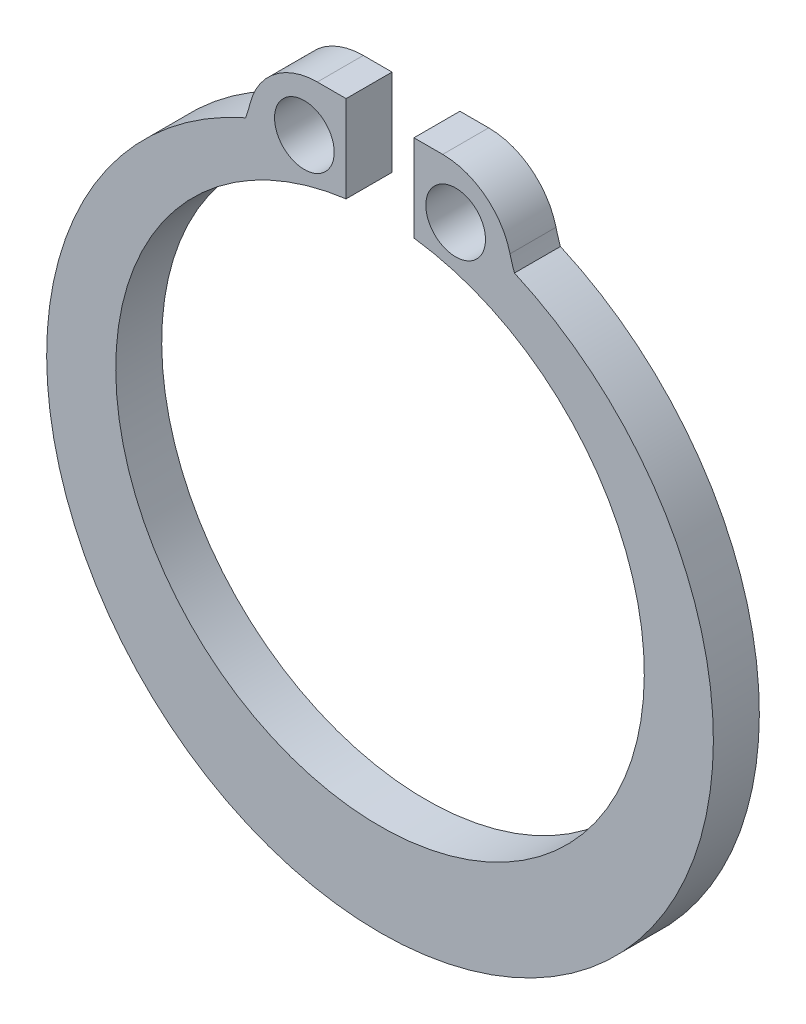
ISO-10303-21;
HEADER;
FILE_DESCRIPTION(('STEP AP214'),'2;1');
FILE_NAME('part.step','',(''),(''),'','','');
FILE_SCHEMA(('AUTOMOTIVE_DESIGN { 1 0 10303 214 1 1 1 1 }'));
ENDSEC;
DATA;
#1=APPLICATION_CONTEXT('core data for automotive mechanical design processes');
#2=APPLICATION_PROTOCOL_DEFINITION('international standard','automotive_design',2000,#1);
#3=PRODUCT_CONTEXT('',#1,'mechanical');
#4=PRODUCT('Part','Part','',(#3));
#5=PRODUCT_RELATED_PRODUCT_CATEGORY('part','',(#4));
#6=PRODUCT_DEFINITION_FORMATION('','',#4);
#7=PRODUCT_DEFINITION_CONTEXT('part definition',#1,'design');
#8=PRODUCT_DEFINITION('design','',#6,#7);
#9=PRODUCT_DEFINITION_SHAPE('','',#8);
#10=(LENGTH_UNIT() NAMED_UNIT(*) SI_UNIT(.MILLI.,.METRE.));
#11=(NAMED_UNIT(*) PLANE_ANGLE_UNIT() SI_UNIT($,.RADIAN.));
#12=(NAMED_UNIT(*) SI_UNIT($,.STERADIAN.) SOLID_ANGLE_UNIT());
#13=UNCERTAINTY_MEASURE_WITH_UNIT(LENGTH_MEASURE(1.E-05),#10,'distance_accuracy_value','');
#14=(GEOMETRIC_REPRESENTATION_CONTEXT(3) GLOBAL_UNCERTAINTY_ASSIGNED_CONTEXT((#13)) GLOBAL_UNIT_ASSIGNED_CONTEXT((#10,
#11,#12)) REPRESENTATION_CONTEXT('',''));
#15=CARTESIAN_POINT('',(0.,0.,0.));
#16=DIRECTION('',(0.,0.,1.));
#17=DIRECTION('',(1.,0.,0.));
#18=AXIS2_PLACEMENT_3D('',#15,#16,#17);
#19=CARTESIAN_POINT('',(4.44089209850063E-13,0.499999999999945,1.));
#20=DIRECTION('',(0.,0.,1.));
#21=DIRECTION('',(1.,0.,0.));
#22=AXIS2_PLACEMENT_3D('',#19,#20,#21);
#23=PLANE('',#22);
#24=CARTESIAN_POINT('',(1.6460721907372,6.95112406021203,1.));
#25=DIRECTION('',(0.,0.,-1.));
#26=DIRECTION('',(-1.,0.,0.));
#27=AXIS2_PLACEMENT_3D('',#24,#25,#26);
#28=CIRCLE('',#27,0.649210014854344);
#29=CARTESIAN_POINT('',(0.996862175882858,6.95112406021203,1.));
#30=VERTEX_POINT('',#29);
#31=EDGE_CURVE('E199',#30,#30,#28,.T.);
#32=ORIENTED_EDGE('',*,*,#31,.T.);
#33=EDGE_LOOP('',(#32));
#34=FACE_BOUND('',#33,.T.);
#35=CARTESIAN_POINT('',(4.44089209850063E-13,0.499999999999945,1.));
#36=DIRECTION('',(0.,0.,1.));
#37=DIRECTION('',(1.,0.,0.));
#38=AXIS2_PLACEMENT_3D('',#35,#36,#37);
#39=CIRCLE('',#38,5.75);
#40=CARTESIAN_POINT('',(-0.737991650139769,6.20244406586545,1.));
#41=VERTEX_POINT('',#40);
#42=CARTESIAN_POINT('',(0.737991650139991,6.20244406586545,1.));
#43=VERTEX_POINT('',#42);
#44=EDGE_CURVE('E117',#41,#43,#39,.T.);
#45=ORIENTED_EDGE('',*,*,#44,.F.);
#46=DIRECTION('',(0.,-1.,0.));
#47=VECTOR('',#46,1.);
#48=CARTESIAN_POINT('',(-0.737991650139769,8.09216813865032,1.));
#49=LINE('',#48,#47);
#50=CARTESIAN_POINT('',(-0.737991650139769,8.09216813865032,1.));
#51=VERTEX_POINT('',#50);
#52=EDGE_CURVE('E181',#51,#41,#49,.T.);
#53=ORIENTED_EDGE('',*,*,#52,.F.);
#54=DIRECTION('',(-1.,0.,0.));
#55=VECTOR('',#54,1.);
#56=CARTESIAN_POINT('',(-0.737991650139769,8.09216813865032,1.));
#57=LINE('',#56,#55);
#58=CARTESIAN_POINT('',(-1.36399396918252,8.09216813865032,1.));
#59=VERTEX_POINT('',#58);
#60=EDGE_CURVE('E114',#51,#59,#57,.T.);
#61=ORIENTED_EDGE('',*,*,#60,.T.);
#62=CARTESIAN_POINT('',(-1.36399396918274,6.58162042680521,1.));
#63=DIRECTION('',(0.,0.,1.));
#64=DIRECTION('',(1.,0.,0.));
#65=AXIS2_PLACEMENT_3D('',#62,#63,#64);
#66=CIRCLE('',#65,1.51054771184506);
#67=CARTESIAN_POINT('',(-2.82865142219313,6.95112406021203,1.));
#68=VERTEX_POINT('',#67);
#69=EDGE_CURVE('E187',#59,#68,#66,.T.);
#70=ORIENTED_EDGE('',*,*,#69,.T.);
#71=CARTESIAN_POINT('',(-5.98071916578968,7.74632739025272,1.));
#72=DIRECTION('',(0.,0.,-1.));
#73=DIRECTION('',(-1.,0.,0.));
#74=AXIS2_PLACEMENT_3D('',#71,#72,#73);
#75=CIRCLE('',#74,3.25082749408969);
#76=CARTESIAN_POINT('',(-2.92503228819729,6.63697753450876,1.));
#77=VERTEX_POINT('',#76);
#78=EDGE_CURVE('E185',#68,#77,#75,.T.);
#79=ORIENTED_EDGE('',*,*,#78,.T.);
#80=CARTESIAN_POINT('',(0.,0.,1.));
#81=DIRECTION('',(0.,0.,1.));
#82=DIRECTION('',(1.,0.,0.));
#83=AXIS2_PLACEMENT_3D('',#80,#81,#82);
#84=CIRCLE('',#83,7.25295006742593);
#85=CARTESIAN_POINT('',(2.92503228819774,6.63697753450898,1.));
#86=VERTEX_POINT('',#85);
#87=EDGE_CURVE('E110',#77,#86,#84,.T.);
#88=ORIENTED_EDGE('',*,*,#87,.T.);
#89=CARTESIAN_POINT('',(5.98071916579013,7.74632739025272,1.));
#90=DIRECTION('',(0.,0.,1.));
#91=DIRECTION('',(1.,0.,0.));
#92=AXIS2_PLACEMENT_3D('',#89,#90,#91);
#93=CIRCLE('',#92,3.25082749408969);
#94=CARTESIAN_POINT('',(2.8286514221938,6.95112406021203,1.));
#95=VERTEX_POINT('',#94);
#96=EDGE_CURVE('E108',#95,#86,#93,.T.);
#97=ORIENTED_EDGE('',*,*,#96,.F.);
#98=CARTESIAN_POINT('',(1.36399396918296,6.58162042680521,1.));
#99=DIRECTION('',(0.,0.,-1.));
#100=DIRECTION('',(-1.,0.,0.));
#101=AXIS2_PLACEMENT_3D('',#98,#99,#100);
#102=CIRCLE('',#101,1.51054771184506);
#103=CARTESIAN_POINT('',(1.36399396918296,8.09216813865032,1.));
#104=VERTEX_POINT('',#103);
#105=EDGE_CURVE('E85',#104,#95,#102,.T.);
#106=ORIENTED_EDGE('',*,*,#105,.F.);
#107=DIRECTION('',(1.,0.,0.));
#108=VECTOR('',#107,1.);
#109=CARTESIAN_POINT('',(0.737991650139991,8.09216813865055,1.));
#110=LINE('',#109,#108);
#111=CARTESIAN_POINT('',(0.737991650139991,8.09216813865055,1.));
#112=VERTEX_POINT('',#111);
#113=EDGE_CURVE('E97',#112,#104,#110,.T.);
#114=ORIENTED_EDGE('',*,*,#113,.F.);
#115=DIRECTION('',(0.,-1.,0.));
#116=VECTOR('',#115,1.);
#117=CARTESIAN_POINT('',(0.737991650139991,8.09216813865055,1.));
#118=LINE('',#117,#116);
#119=EDGE_CURVE('E102',#112,#43,#118,.T.);
#120=ORIENTED_EDGE('',*,*,#119,.T.);
#121=EDGE_LOOP('',(#45,#53,#61,#70,#79,#88,#97,#106,#114,#120));
#122=FACE_BOUND('',#121,.T.);
#123=CARTESIAN_POINT('',(-1.64607219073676,6.95112406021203,1.));
#124=DIRECTION('',(0.,0.,1.));
#125=DIRECTION('',(1.,0.,0.));
#126=AXIS2_PLACEMENT_3D('',#123,#124,#125);
#127=CIRCLE('',#126,0.649210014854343);
#128=CARTESIAN_POINT('',(-0.996862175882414,6.95112406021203,1.));
#129=VERTEX_POINT('',#128);
#130=EDGE_CURVE('E159',#129,#129,#127,.T.);
#131=ORIENTED_EDGE('',*,*,#130,.F.);
#132=EDGE_LOOP('',(#131));
#133=FACE_BOUND('',#132,.T.);
#134=ADVANCED_FACE('F30',(#34,#122,#133),#23,.T.);
#135=CARTESIAN_POINT('',(4.44089209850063E-13,0.499999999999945,0.));
#136=DIRECTION('',(0.,0.,1.));
#137=DIRECTION('',(1.,0.,0.));
#138=AXIS2_PLACEMENT_3D('',#135,#136,#137);
#139=PLANE('',#138);
#140=CARTESIAN_POINT('',(1.6460721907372,6.95112406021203,0.));
#141=DIRECTION('',(0.,0.,-1.));
#142=DIRECTION('',(-1.,0.,0.));
#143=AXIS2_PLACEMENT_3D('',#140,#141,#142);
#144=CIRCLE('',#143,0.649210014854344);
#145=CARTESIAN_POINT('',(0.996862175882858,6.95112406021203,0.));
#146=VERTEX_POINT('',#145);
#147=EDGE_CURVE('E202',#146,#146,#144,.T.);
#148=ORIENTED_EDGE('',*,*,#147,.F.);
#149=EDGE_LOOP('',(#148));
#150=FACE_BOUND('',#149,.T.);
#151=CARTESIAN_POINT('',(4.44089209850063E-13,0.499999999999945,0.));
#152=DIRECTION('',(0.,0.,1.));
#153=DIRECTION('',(1.,0.,0.));
#154=AXIS2_PLACEMENT_3D('',#151,#152,#153);
#155=CIRCLE('',#154,5.75);
#156=CARTESIAN_POINT('',(-0.737991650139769,6.20244406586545,0.));
#157=VERTEX_POINT('',#156);
#158=CARTESIAN_POINT('',(0.737991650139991,6.20244406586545,0.));
#159=VERTEX_POINT('',#158);
#160=EDGE_CURVE('E182',#157,#159,#155,.T.);
#161=ORIENTED_EDGE('',*,*,#160,.T.);
#162=DIRECTION('',(0.,-1.,0.));
#163=VECTOR('',#162,1.);
#164=CARTESIAN_POINT('',(0.737991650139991,8.09216813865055,0.));
#165=LINE('',#164,#163);
#166=CARTESIAN_POINT('',(0.737991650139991,8.09216813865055,0.));
#167=VERTEX_POINT('',#166);
#168=EDGE_CURVE('E194',#167,#159,#165,.T.);
#169=ORIENTED_EDGE('',*,*,#168,.F.);
#170=DIRECTION('',(1.,0.,0.));
#171=VECTOR('',#170,1.);
#172=CARTESIAN_POINT('',(0.737991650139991,8.09216813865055,0.));
#173=LINE('',#172,#171);
#174=CARTESIAN_POINT('',(1.36399396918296,8.09216813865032,0.));
#175=VERTEX_POINT('',#174);
#176=EDGE_CURVE('E166',#167,#175,#173,.T.);
#177=ORIENTED_EDGE('',*,*,#176,.T.);
#178=CARTESIAN_POINT('',(1.36399396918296,6.58162042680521,0.));
#179=DIRECTION('',(0.,0.,-1.));
#180=DIRECTION('',(-1.,0.,0.));
#181=AXIS2_PLACEMENT_3D('',#178,#179,#180);
#182=CIRCLE('',#181,1.51054771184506);
#183=CARTESIAN_POINT('',(2.8286514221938,6.95112406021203,0.));
#184=VERTEX_POINT('',#183);
#185=EDGE_CURVE('E89',#175,#184,#182,.T.);
#186=ORIENTED_EDGE('',*,*,#185,.T.);
#187=CARTESIAN_POINT('',(5.98071916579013,7.74632739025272,0.));
#188=DIRECTION('',(0.,0.,1.));
#189=DIRECTION('',(1.,0.,0.));
#190=AXIS2_PLACEMENT_3D('',#187,#188,#189);
#191=CIRCLE('',#190,3.25082749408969);
#192=CARTESIAN_POINT('',(2.92503228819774,6.63697753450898,0.));
#193=VERTEX_POINT('',#192);
#194=EDGE_CURVE('E168',#184,#193,#191,.T.);
#195=ORIENTED_EDGE('',*,*,#194,.T.);
#196=CARTESIAN_POINT('',(0.,0.,0.));
#197=DIRECTION('',(0.,0.,1.));
#198=DIRECTION('',(1.,0.,0.));
#199=AXIS2_PLACEMENT_3D('',#196,#197,#198);
#200=CIRCLE('',#199,7.25295006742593);
#201=CARTESIAN_POINT('',(-2.92503228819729,6.63697753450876,0.));
#202=VERTEX_POINT('',#201);
#203=EDGE_CURVE('E171',#202,#193,#200,.T.);
#204=ORIENTED_EDGE('',*,*,#203,.F.);
#205=CARTESIAN_POINT('',(-5.98071916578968,7.74632739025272,0.));
#206=DIRECTION('',(0.,0.,-1.));
#207=DIRECTION('',(-1.,0.,0.));
#208=AXIS2_PLACEMENT_3D('',#205,#206,#207);
#209=CIRCLE('',#208,3.25082749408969);
#210=CARTESIAN_POINT('',(-2.82865142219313,6.95112406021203,0.));
#211=VERTEX_POINT('',#210);
#212=EDGE_CURVE('E174',#211,#202,#209,.T.);
#213=ORIENTED_EDGE('',*,*,#212,.F.);
#214=CARTESIAN_POINT('',(-1.36399396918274,6.58162042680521,0.));
#215=DIRECTION('',(0.,0.,1.));
#216=DIRECTION('',(1.,0.,0.));
#217=AXIS2_PLACEMENT_3D('',#214,#215,#216);
#218=CIRCLE('',#217,1.51054771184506);
#219=CARTESIAN_POINT('',(-1.36399396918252,8.09216813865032,0.));
#220=VERTEX_POINT('',#219);
#221=EDGE_CURVE('E156',#220,#211,#218,.T.);
#222=ORIENTED_EDGE('',*,*,#221,.F.);
#223=DIRECTION('',(-1.,0.,0.));
#224=VECTOR('',#223,1.);
#225=CARTESIAN_POINT('',(-0.737991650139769,8.09216813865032,0.));
#226=LINE('',#225,#224);
#227=CARTESIAN_POINT('',(-0.737991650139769,8.09216813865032,0.));
#228=VERTEX_POINT('',#227);
#229=EDGE_CURVE('E139',#228,#220,#226,.T.);
#230=ORIENTED_EDGE('',*,*,#229,.F.);
#231=DIRECTION('',(0.,-1.,0.));
#232=VECTOR('',#231,1.);
#233=CARTESIAN_POINT('',(-0.737991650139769,8.09216813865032,0.));
#234=LINE('',#233,#232);
#235=EDGE_CURVE('E153',#228,#157,#234,.T.);
#236=ORIENTED_EDGE('',*,*,#235,.T.);
#237=EDGE_LOOP('',(#161,#169,#177,#186,#195,#204,#213,#222,#230,#236));
#238=FACE_BOUND('',#237,.T.);
#239=CARTESIAN_POINT('',(-1.64607219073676,6.95112406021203,0.));
#240=DIRECTION('',(0.,0.,1.));
#241=DIRECTION('',(1.,0.,0.));
#242=AXIS2_PLACEMENT_3D('',#239,#240,#241);
#243=CIRCLE('',#242,0.649210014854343);
#244=CARTESIAN_POINT('',(-0.996862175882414,6.95112406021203,0.));
#245=VERTEX_POINT('',#244);
#246=EDGE_CURVE('E162',#245,#245,#243,.T.);
#247=ORIENTED_EDGE('',*,*,#246,.T.);
#248=EDGE_LOOP('',(#247));
#249=FACE_BOUND('',#248,.T.);
#250=ADVANCED_FACE('F151',(#150,#238,#249),#139,.F.);
#251=CARTESIAN_POINT('',(4.44089209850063E-13,0.499999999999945,1.));
#252=DIRECTION('',(0.,0.,-1.));
#253=DIRECTION('',(-1.,0.,0.));
#254=AXIS2_PLACEMENT_3D('',#251,#252,#253);
#255=CYLINDRICAL_SURFACE('',#254,5.75);
#256=DIRECTION('',(0.,0.,-1.));
#257=VECTOR('',#256,1.);
#258=CARTESIAN_POINT('',(-0.737991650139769,6.20244406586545,1.));
#259=LINE('',#258,#257);
#260=EDGE_CURVE('E11',#41,#157,#259,.T.);
#261=ORIENTED_EDGE('',*,*,#260,.F.);
#262=ORIENTED_EDGE('',*,*,#44,.T.);
#263=DIRECTION('',(0.,0.,-1.));
#264=VECTOR('',#263,1.);
#265=CARTESIAN_POINT('',(0.737991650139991,6.20244406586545,1.));
#266=LINE('',#265,#264);
#267=EDGE_CURVE('E46',#43,#159,#266,.T.);
#268=ORIENTED_EDGE('',*,*,#267,.T.);
#269=ORIENTED_EDGE('',*,*,#160,.F.);
#270=EDGE_LOOP('',(#261,#262,#268,#269));
#271=FACE_BOUND('',#270,.T.);
#272=ADVANCED_FACE('F191',(#271),#255,.F.);
#273=CARTESIAN_POINT('',(-0.737991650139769,8.09216813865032,1.));
#274=DIRECTION('',(1.,0.,0.));
#275=DIRECTION('',(0.,1.,0.));
#276=AXIS2_PLACEMENT_3D('',#273,#274,#275);
#277=PLANE('',#276);
#278=DIRECTION('',(0.,0.,-1.));
#279=VECTOR('',#278,1.);
#280=CARTESIAN_POINT('',(-0.737991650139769,8.09216813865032,1.));
#281=LINE('',#280,#279);
#282=EDGE_CURVE('E39',#51,#228,#281,.T.);
#283=ORIENTED_EDGE('',*,*,#282,.F.);
#284=ORIENTED_EDGE('',*,*,#52,.T.);
#285=ORIENTED_EDGE('',*,*,#260,.T.);
#286=ORIENTED_EDGE('',*,*,#235,.F.);
#287=EDGE_LOOP('',(#283,#284,#285,#286));
#288=FACE_BOUND('',#287,.T.);
#289=ADVANCED_FACE('F32',(#288),#277,.T.);
#290=CARTESIAN_POINT('',(-0.737991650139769,8.09216813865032,1.));
#291=DIRECTION('',(0.,-1.,0.));
#292=DIRECTION('',(0.,0.,-1.));
#293=AXIS2_PLACEMENT_3D('',#290,#291,#292);
#294=PLANE('',#293);
#295=DIRECTION('',(0.,0.,-1.));
#296=VECTOR('',#295,1.);
#297=CARTESIAN_POINT('',(-1.36399396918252,8.09216813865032,1.));
#298=LINE('',#297,#296);
#299=EDGE_CURVE('E129',#59,#220,#298,.T.);
#300=ORIENTED_EDGE('',*,*,#299,.F.);
#301=ORIENTED_EDGE('',*,*,#60,.F.);
#302=ORIENTED_EDGE('',*,*,#282,.T.);
#303=ORIENTED_EDGE('',*,*,#229,.T.);
#304=EDGE_LOOP('',(#300,#301,#302,#303));
#305=FACE_BOUND('',#304,.T.);
#306=ADVANCED_FACE('F137',(#305),#294,.F.);
#307=CARTESIAN_POINT('',(-1.36399396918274,6.58162042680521,1.));
#308=DIRECTION('',(0.,0.,-1.));
#309=DIRECTION('',(-1.,0.,0.));
#310=AXIS2_PLACEMENT_3D('',#307,#308,#309);
#311=CYLINDRICAL_SURFACE('',#310,1.51054771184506);
#312=DIRECTION('',(0.,0.,-1.));
#313=VECTOR('',#312,1.);
#314=CARTESIAN_POINT('',(-2.82865142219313,6.95112406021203,1.));
#315=LINE('',#314,#313);
#316=EDGE_CURVE('E126',#68,#211,#315,.T.);
#317=ORIENTED_EDGE('',*,*,#316,.F.);
#318=ORIENTED_EDGE('',*,*,#69,.F.);
#319=ORIENTED_EDGE('',*,*,#299,.T.);
#320=ORIENTED_EDGE('',*,*,#221,.T.);
#321=EDGE_LOOP('',(#317,#318,#319,#320));
#322=FACE_BOUND('',#321,.T.);
#323=ADVANCED_FACE('F239',(#322),#311,.T.);
#324=CARTESIAN_POINT('',(-5.98071916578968,7.74632739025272,1.));
#325=DIRECTION('',(0.,0.,-1.));
#326=DIRECTION('',(-1.,0.,0.));
#327=AXIS2_PLACEMENT_3D('',#324,#325,#326);
#328=CYLINDRICAL_SURFACE('',#327,3.25082749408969);
#329=DIRECTION('',(0.,0.,-1.));
#330=VECTOR('',#329,1.);
#331=CARTESIAN_POINT('',(-2.92503228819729,6.63697753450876,1.));
#332=LINE('',#331,#330);
#333=EDGE_CURVE('E123',#77,#202,#332,.T.);
#334=ORIENTED_EDGE('',*,*,#333,.F.);
#335=ORIENTED_EDGE('',*,*,#78,.F.);
#336=ORIENTED_EDGE('',*,*,#316,.T.);
#337=ORIENTED_EDGE('',*,*,#212,.T.);
#338=EDGE_LOOP('',(#334,#335,#336,#337));
#339=FACE_BOUND('',#338,.T.);
#340=ADVANCED_FACE('F235',(#339),#328,.F.);
#341=CARTESIAN_POINT('',(0.,0.,1.));
#342=DIRECTION('',(0.,0.,-1.));
#343=DIRECTION('',(-1.,0.,0.));
#344=AXIS2_PLACEMENT_3D('',#341,#342,#343);
#345=CYLINDRICAL_SURFACE('',#344,7.25295006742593);
#346=DIRECTION('',(0.,0.,-1.));
#347=VECTOR('',#346,1.);
#348=CARTESIAN_POINT('',(2.92503228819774,6.63697753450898,1.));
#349=LINE('',#348,#347);
#350=EDGE_CURVE('E120',#86,#193,#349,.T.);
#351=ORIENTED_EDGE('',*,*,#350,.F.);
#352=ORIENTED_EDGE('',*,*,#87,.F.);
#353=ORIENTED_EDGE('',*,*,#333,.T.);
#354=ORIENTED_EDGE('',*,*,#203,.T.);
#355=EDGE_LOOP('',(#351,#352,#353,#354));
#356=FACE_BOUND('',#355,.T.);
#357=ADVANCED_FACE('F231',(#356),#345,.T.);
#358=CARTESIAN_POINT('',(5.98071916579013,7.74632739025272,1.));
#359=DIRECTION('',(0.,0.,-1.));
#360=DIRECTION('',(-1.,0.,0.));
#361=AXIS2_PLACEMENT_3D('',#358,#359,#360);
#362=CYLINDRICAL_SURFACE('',#361,3.25082749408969);
#363=DIRECTION('',(0.,0.,-1.));
#364=VECTOR('',#363,1.);
#365=CARTESIAN_POINT('',(2.8286514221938,6.95112406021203,1.));
#366=LINE('',#365,#364);
#367=EDGE_CURVE('E93',#95,#184,#366,.T.);
#368=ORIENTED_EDGE('',*,*,#367,.F.);
#369=ORIENTED_EDGE('',*,*,#96,.T.);
#370=ORIENTED_EDGE('',*,*,#350,.T.);
#371=ORIENTED_EDGE('',*,*,#194,.F.);
#372=EDGE_LOOP('',(#368,#369,#370,#371));
#373=FACE_BOUND('',#372,.T.);
#374=ADVANCED_FACE('F228',(#373),#362,.F.);
#375=CARTESIAN_POINT('',(1.36399396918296,6.58162042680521,1.));
#376=DIRECTION('',(0.,0.,-1.));
#377=DIRECTION('',(-1.,0.,0.));
#378=AXIS2_PLACEMENT_3D('',#375,#376,#377);
#379=CYLINDRICAL_SURFACE('',#378,1.51054771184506);
#380=DIRECTION('',(0.,0.,-1.));
#381=VECTOR('',#380,1.);
#382=CARTESIAN_POINT('',(1.36399396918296,8.09216813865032,1.));
#383=LINE('',#382,#381);
#384=EDGE_CURVE('E80',#104,#175,#383,.T.);
#385=ORIENTED_EDGE('',*,*,#384,.F.);
#386=ORIENTED_EDGE('',*,*,#105,.T.);
#387=ORIENTED_EDGE('',*,*,#367,.T.);
#388=ORIENTED_EDGE('',*,*,#185,.F.);
#389=EDGE_LOOP('',(#385,#386,#387,#388));
#390=FACE_BOUND('',#389,.T.);
#391=ADVANCED_FACE('F82',(#390),#379,.T.);
#392=CARTESIAN_POINT('',(0.737991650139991,8.09216813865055,1.));
#393=DIRECTION('',(0.,1.,0.));
#394=DIRECTION('',(0.,0.,1.));
#395=AXIS2_PLACEMENT_3D('',#392,#393,#394);
#396=PLANE('',#395);
#397=DIRECTION('',(0.,0.,-1.));
#398=VECTOR('',#397,1.);
#399=CARTESIAN_POINT('',(0.737991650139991,8.09216813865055,1.));
#400=LINE('',#399,#398);
#401=EDGE_CURVE('E94',#112,#167,#400,.T.);
#402=ORIENTED_EDGE('',*,*,#401,.F.);
#403=ORIENTED_EDGE('',*,*,#113,.T.);
#404=ORIENTED_EDGE('',*,*,#384,.T.);
#405=ORIENTED_EDGE('',*,*,#176,.F.);
#406=EDGE_LOOP('',(#402,#403,#404,#405));
#407=FACE_BOUND('',#406,.T.);
#408=ADVANCED_FACE('F98',(#407),#396,.T.);
#409=CARTESIAN_POINT('',(0.737991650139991,8.09216813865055,1.));
#410=DIRECTION('',(1.,0.,0.));
#411=DIRECTION('',(0.,1.,0.));
#412=AXIS2_PLACEMENT_3D('',#409,#410,#411);
#413=PLANE('',#412);
#414=ORIENTED_EDGE('',*,*,#119,.F.);
#415=ORIENTED_EDGE('',*,*,#401,.T.);
#416=ORIENTED_EDGE('',*,*,#168,.T.);
#417=ORIENTED_EDGE('',*,*,#267,.F.);
#418=EDGE_LOOP('',(#414,#415,#416,#417));
#419=FACE_BOUND('',#418,.T.);
#420=ADVANCED_FACE('F221',(#419),#413,.F.);
#421=CARTESIAN_POINT('',(-1.64607219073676,6.95112406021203,1.));
#422=DIRECTION('',(0.,0.,-1.));
#423=DIRECTION('',(-1.,0.,0.));
#424=AXIS2_PLACEMENT_3D('',#421,#422,#423);
#425=CYLINDRICAL_SURFACE('',#424,0.649210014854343);
#426=ORIENTED_EDGE('',*,*,#130,.T.);
#427=EDGE_LOOP('',(#426));
#428=FACE_BOUND('',#427,.T.);
#429=ORIENTED_EDGE('',*,*,#246,.F.);
#430=EDGE_LOOP('',(#429));
#431=FACE_BOUND('',#430,.T.);
#432=ADVANCED_FACE('F218',(#428,#431),#425,.F.);
#433=CARTESIAN_POINT('',(1.6460721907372,6.95112406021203,1.));
#434=DIRECTION('',(0.,0.,-1.));
#435=DIRECTION('',(-1.,0.,0.));
#436=AXIS2_PLACEMENT_3D('',#433,#434,#435);
#437=CYLINDRICAL_SURFACE('',#436,0.649210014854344);
#438=ORIENTED_EDGE('',*,*,#31,.F.);
#439=EDGE_LOOP('',(#438));
#440=FACE_BOUND('',#439,.T.);
#441=ORIENTED_EDGE('',*,*,#147,.T.);
#442=EDGE_LOOP('',(#441));
#443=FACE_BOUND('',#442,.T.);
#444=ADVANCED_FACE('F206',(#440,#443),#437,.F.);
#445=CLOSED_SHELL('',(#134,#250,#272,#289,#306,#323,#340,#357,#374,#391,#408,#420,#432,#444));
#446=MANIFOLD_SOLID_BREP('B2',#445);
#447=ADVANCED_BREP_SHAPE_REPRESENTATION('',(#18,#446),#14);
#448=SHAPE_DEFINITION_REPRESENTATION(#9,#447);
ENDSEC;
END-ISO-10303-21;
